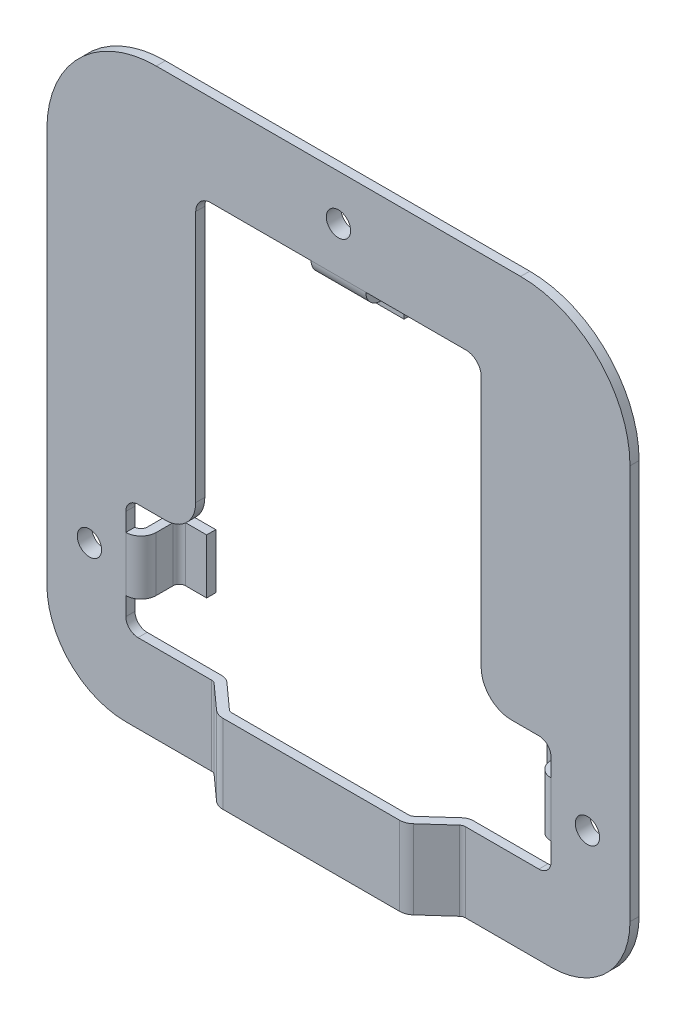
from build123d import *

# Parameters (mm, degrees)
EXTRUDE_1_DEPTH      = 1.5
SKETCH_2_R           = 2
CUT_EXTRUDE_1_DEPTH  = 2
EXTRUDE_2_DEPTH      = 13
FILLET_1_R           = 2
FILLET_2_R           = 1
EXTRUDE_3_DEPTH      = 4.5
EXTRUDE_3_DEPTH_BACK = 4.5
EXTRUDE_4_DEPTH      = 4.5
EXTRUDE_4_DEPTH_BACK = 4.5
FILLET_3_R           = 2.5
FILLET_4_R           = 1
SKETCH_8_R           = 2.6
SKETCH_8_R_2         = 2
EXTRUDE_5_DEPTH      = 0.9


with BuildPart() as part:
    # Sketch 1 → Extrude 1 (new body)
    with BuildSketch(Plane.XY):
        with BuildLine():
            Line((13, 0), (83, 0))
            ThreePointArc((83, 0), (92.192388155, 3.807611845), (96, 13))
            Line((96, 13), (96, 78))
            ThreePointArc((96, 78), (90.727922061, 90.727922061), (78, 96))
            Line((78, 96), (18, 96))
            ThreePointArc((18, 96), (5.272077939, 90.727922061), (0, 78))
            Line((0, 78), (0, 13))
            ThreePointArc((0, 13), (3.807611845, 3.807611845), (13, 0))
        make_face()
    extrude(amount=-EXTRUDE_1_DEPTH)

    # Sketch 2 → Cut-Extrude 1 (cut)
    with BuildSketch(Plane.XY):
        with Locations((48, 88.5)):
            Circle(SKETCH_2_R)
        with Locations((89, 22.5)):
            Circle(SKETCH_2_R)
        with Locations((7, 22.5)):
            Circle(SKETCH_2_R)
        with BuildLine():
            Line((27, 81), (69, 81))
            ThreePointArc((69, 81), (70.767766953, 80.267766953), (71.5, 78.5))
            Line((71.5, 78.5), (71.5, 37))
            ThreePointArc((71.5, 37), (72.964466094, 33.464466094), (76.5, 32))
            Line((76.5, 32), (81, 32))
            ThreePointArc((81, 32), (82.414213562, 31.414213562), (83, 30))
            Line((83, 30), (83, 15))
            ThreePointArc((83, 15), (82.414213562, 13.585786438), (81, 13))
            Line((81, 13), (68.5, 13))
            Line((68.5, 13), (68.5, 0))
            Line((68.5, 0), (48, 0))
            Line((48, 0), (27.5, 0))
            Line((27.5, 0), (27.5, 13))
            Line((27.5, 13), (15, 13))
            ThreePointArc((15, 13), (13.585786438, 13.585786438), (13, 15))
            Line((13, 15), (13, 30))
            ThreePointArc((13, 30), (13.585786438, 31.414213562), (15, 32))
            Line((15, 32), (19.5, 32))
            ThreePointArc((19.5, 32), (23.035533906, 33.464466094), (24.5, 37))
            Line((24.5, 37), (24.5, 78.5))
            ThreePointArc((24.5, 78.5), (25.232233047, 80.267766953), (27, 81))
        make_face()
    extrude(amount=-CUT_EXTRUDE_1_DEPTH, mode=Mode.SUBTRACT)

    # Sketch 3 → Extrude 2 (add)
    with BuildSketch(Plane.XZ):
        with BuildLine():
            Line((63.209624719, 2.743294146), (67.924395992, -1.5))
            Line((67.924395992, -1.5), (68.5, -1.5))
            Line((68.5, -1.5), (68.5, 0))
            Line((68.5, 0), (64.213071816, 3.858235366))
            ThreePointArc((64.213071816, 3.858235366), (63.436319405, 4.334051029), (62.540659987, 4.5))
            Line((62.540659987, 4.5), (33.459340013, 4.5))
            ThreePointArc((33.459340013, 4.5), (32.563680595, 4.334051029), (31.786928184, 3.858235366))
            Line((31.786928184, 3.858235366), (27.5, 0))
            Line((27.5, 0), (27.5, -1.5))
            Line((27.5, -1.5), (28.075604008, -1.5))
            Line((28.075604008, -1.5), (32.790375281, 2.743294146))
            ThreePointArc((32.790375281, 2.743294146), (33.101076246, 2.933620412), (33.459340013, 3))
            Line((33.459340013, 3), (62.540659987, 3))
            ThreePointArc((62.540659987, 3), (62.898923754, 2.933620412), (63.209624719, 2.743294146))
        make_face()
    extrude(amount=-EXTRUDE_2_DEPTH)

    # Fillet 1
    fillet_1_edges = [part.edges().sort_by_distance(p)[0] for p in [
        (67.924395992, 6.5, -1.5),
        (28.075604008, 6.5, -1.5),
    ]]
    fillet(fillet_1_edges, radius=FILLET_1_R)

    # Fillet 2
    fillet_2_edges = [part.edges().sort_by_distance(p)[0] for p in [
        (27.5, 6.5, 0),
        (68.5, 6.5, 0),
    ]]
    fillet(fillet_2_edges, radius=FILLET_2_R)

    # Sketch 5 → Extrude 3 (add, two sides: drawn at the far end of the back side and taken through both)
    with BuildSketch(Plane(origin=(0, 22.5, 0), x_dir=(-1, 0, 0), z_dir=(0, 1, 0)).offset(-EXTRUDE_3_DEPTH_BACK)):
        with BuildLine():
            Line((-83, -1.5), (-82, -1.5))
            Line((-82, -1.5), (-82, -5.3))
            ThreePointArc((-82, -5.3), (-81.267766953, -7.067766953), (-79.5, -7.8))
            Line((-79.5, -7.8), (-76, -7.8))
            Line((-76, -7.8), (-76, -6.3))
            Line((-76, -6.3), (-79.5, -6.3))
            ThreePointArc((-79.5, -6.3), (-80.207106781, -6.007106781), (-80.5, -5.3))
            Line((-80.5, -5.3), (-80.5, 0))
            Line((-80.5, 0), (-83, 0))
            Line((-83, 0), (-83, -1.5))
        make_face()
        with BuildLine():
            Line((-13, 0), (-13, -1.5))
            Line((-13, -1.5), (-14, -1.5))
            Line((-14, -1.5), (-14, -5.3))
            ThreePointArc((-14, -5.3), (-14.732233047, -7.067766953), (-16.5, -7.8))
            Line((-16.5, -7.8), (-20, -7.8))
            Line((-20, -7.8), (-20, -6.3))
            Line((-20, -6.3), (-16.5, -6.3))
            ThreePointArc((-16.5, -6.3), (-15.792893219, -6.007106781), (-15.5, -5.3))
            Line((-15.5, -5.3), (-15.5, 0))
            Line((-15.5, 0), (-13, 0))
        make_face()
    extrude(amount=EXTRUDE_3_DEPTH + EXTRUDE_3_DEPTH_BACK)

    # Sketch 7 → Extrude 4 (add, two sides: drawn at the far end of the back side and taken through both)
    with BuildSketch(Plane(origin=(48, 0, 0), x_dir=(0, -1, 0), z_dir=(-1, 0, 0)).offset(-EXTRUDE_4_DEPTH_BACK)):
        with BuildLine():
            Line((-81, -1.5), (-80, -1.5))
            Line((-80, -1.5), (-80, -5.3))
            ThreePointArc((-80, -5.3), (-79.267766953, -7.067766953), (-77.5, -7.8))
            Line((-77.5, -7.8), (-74, -7.8))
            Line((-74, -7.8), (-74, -6.3))
            Line((-74, -6.3), (-77.5, -6.3))
            ThreePointArc((-77.5, -6.3), (-78.207106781, -6.007106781), (-78.5, -5.3))
            Line((-78.5, -5.3), (-78.5, 0))
            Line((-78.5, 0), (-81, 0))
            Line((-81, 0), (-81, -1.5))
        make_face()
    extrude(amount=EXTRUDE_4_DEPTH + EXTRUDE_4_DEPTH_BACK)

    # Fillet 3
    fillet_3_edges = [part.edges().sort_by_distance(p)[0] for p in [
        (15.5, 22.5, 0),
        (80.5, 22.5, 0),
        (48, 78.5, 0),
    ]]
    fillet(fillet_3_edges, radius=FILLET_3_R)

    # Fillet 4
    fillet_4_edges = [part.edges().sort_by_distance(p)[0] for p in [
        (14, 22.5, -1.5),
        (82, 22.5, -1.5),
        (48, 80, -1.5),
    ]]
    fillet(fillet_4_edges, radius=FILLET_4_R)

    # Sketch 8 → Extrude 5 (add)
    # profile 1 of 3: a face of its own
    with BuildSketch(Plane(origin=(0, 0, -1.5), x_dir=(-1, 0, 0), z_dir=(0, 0, -1))):
        with Locations((-48, 88.5)):
            Circle(SKETCH_8_R)
        with Locations(Location((-48, 88.5, 0), (0, 0, 180))):
            Circle(SKETCH_8_R_2, mode=Mode.SUBTRACT)
    # profile 2 of 3: a face of its own
    with BuildSketch(Plane(origin=(0, 0, -1.5), x_dir=(-1, 0, 0), z_dir=(0, 0, -1))):
        with Locations((-7, 22.5)):
            Circle(SKETCH_8_R)
        with Locations(Location((-7, 22.5, 0), (0, 0, 180))):
            Circle(SKETCH_8_R_2, mode=Mode.SUBTRACT)
    # profile 3 of 3: a face of its own
    with BuildSketch(Plane(origin=(0, 0, -1.5), x_dir=(-1, 0, 0), z_dir=(0, 0, -1))):
        with Locations((-89, 22.5)):
            Circle(SKETCH_8_R)
        with Locations(Location((-89, 22.5, 0), (0, 0, 180))):
            Circle(SKETCH_8_R_2, mode=Mode.SUBTRACT)
    extrude(amount=EXTRUDE_5_DEPTH)


solid = part.part
